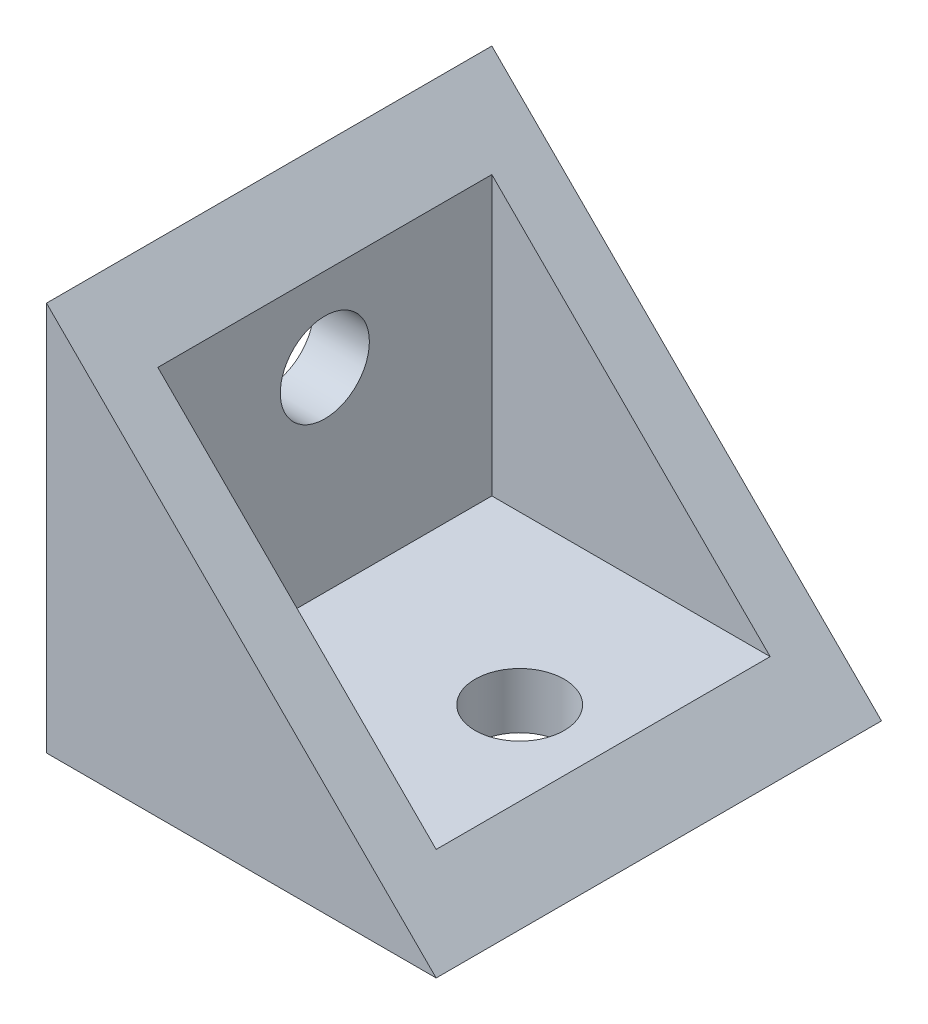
from build123d import *

# Parameters (mm, degrees)
BOSS_EXTRUDE1_DEPTH = 20
SHELL2_T            = -5
SKETCH2_R           = 4
CUT_EXTRUDE1_DEPTH  = 41.078048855
SKETCH3_R           = 4
CUT_EXTRUDE2_DEPTH  = 41.078048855


with BuildPart() as part:
    # Sketch1 → Boss-Extrude1 (new, symmetric)
    with BuildSketch(Plane.XY):
        Polygon((-17.5, 17.5), (17.5, -17.5), (-17.5, -17.5), align=None)
    extrude(amount=BOSS_EXTRUDE1_DEPTH, both=True)

    # Shell2
    shell2_openings = [part.faces().sort_by_distance(p)[0] for p in [
        (0, 0, 0),
    ]]
    offset(amount=SHELL2_T, openings=shell2_openings, kind=Kind.INTERSECTION)

    # Sketch2 → Cut-Extrude1 (cut, through all)
    with BuildSketch(Plane(origin=(0, -12.5, 0), x_dir=(1, 0, 0), z_dir=(0, 1, 0))):
        with Locations(Location((5, 0, 0), (0, 0, 270))):
            Circle(SKETCH2_R)
    extrude(amount=-CUT_EXTRUDE1_DEPTH, mode=Mode.SUBTRACT)

    # Sketch3 → Cut-Extrude2 (cut, through all)
    with BuildSketch(Plane(origin=(-12.5, 0, 0), x_dir=(0, 0, -1), z_dir=(1, 0, 0))):
        with Locations((0, 5)):
            Circle(SKETCH3_R)
    extrude(amount=-CUT_EXTRUDE2_DEPTH, mode=Mode.SUBTRACT)


solid = part.part
